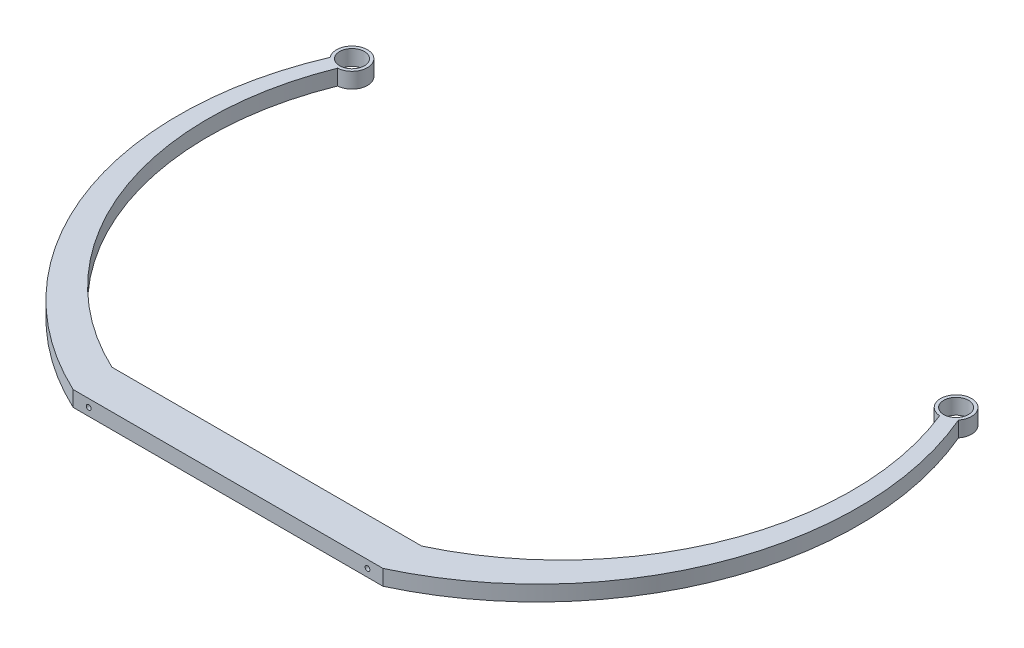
ISO-10303-21;
HEADER;
FILE_DESCRIPTION(('STEP AP214'),'2;1');
FILE_NAME('part.step','',(''),(''),'','','');
FILE_SCHEMA(('AUTOMOTIVE_DESIGN { 1 0 10303 214 1 1 1 1 }'));
ENDSEC;
DATA;
#1=APPLICATION_CONTEXT('core data for automotive mechanical design processes');
#2=APPLICATION_PROTOCOL_DEFINITION('international standard','automotive_design',2000,#1);
#3=PRODUCT_CONTEXT('',#1,'mechanical');
#4=PRODUCT('Part','Part','',(#3));
#5=PRODUCT_RELATED_PRODUCT_CATEGORY('part','',(#4));
#6=PRODUCT_DEFINITION_FORMATION('','',#4);
#7=PRODUCT_DEFINITION_CONTEXT('part definition',#1,'design');
#8=PRODUCT_DEFINITION('design','',#6,#7);
#9=PRODUCT_DEFINITION_SHAPE('','',#8);
#10=(LENGTH_UNIT() NAMED_UNIT(*) SI_UNIT(.MILLI.,.METRE.));
#11=(NAMED_UNIT(*) PLANE_ANGLE_UNIT() SI_UNIT($,.RADIAN.));
#12=(NAMED_UNIT(*) SI_UNIT($,.STERADIAN.) SOLID_ANGLE_UNIT());
#13=UNCERTAINTY_MEASURE_WITH_UNIT(LENGTH_MEASURE(1.E-05),#10,'distance_accuracy_value','');
#14=(GEOMETRIC_REPRESENTATION_CONTEXT(3) GLOBAL_UNCERTAINTY_ASSIGNED_CONTEXT((#13)) GLOBAL_UNIT_ASSIGNED_CONTEXT((#10,
#11,#12)) REPRESENTATION_CONTEXT('',''));
#15=CARTESIAN_POINT('',(0.,0.,0.));
#16=DIRECTION('',(0.,0.,1.));
#17=DIRECTION('',(1.,0.,0.));
#18=AXIS2_PLACEMENT_3D('',#15,#16,#17);
#19=CARTESIAN_POINT('',(-20.,10.,-52.4999999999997));
#20=DIRECTION('',(0.,-1.,0.));
#21=DIRECTION('',(0.,0.,-1.));
#22=AXIS2_PLACEMENT_3D('',#19,#20,#21);
#23=CYLINDRICAL_SURFACE('',#22,187.882942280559);
#24=CARTESIAN_POINT('',(-20.,0.,-52.4999999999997));
#25=DIRECTION('',(0.,1.,0.));
#26=DIRECTION('',(0.,0.,1.));
#27=AXIS2_PLACEMENT_3D('',#24,#25,#26);
#28=CIRCLE('',#27,187.882942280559);
#29=CARTESIAN_POINT('',(-194.347397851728,0.,-122.521317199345));
#30=VERTEX_POINT('',#29);
#31=CARTESIAN_POINT('',(-100.,0.,117.5));
#32=VERTEX_POINT('',#31);
#33=EDGE_CURVE('E134',#30,#32,#28,.T.);
#34=ORIENTED_EDGE('',*,*,#33,.F.);
#35=DIRECTION('',(0.,-1.,0.));
#36=VECTOR('',#35,1.);
#37=CARTESIAN_POINT('',(-194.347397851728,10.,-122.521317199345));
#38=LINE('',#37,#36);
#39=CARTESIAN_POINT('',(-194.347397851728,10.,-122.521317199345));
#40=VERTEX_POINT('',#39);
#41=EDGE_CURVE('E11',#40,#30,#38,.T.);
#42=ORIENTED_EDGE('',*,*,#41,.F.);
#43=CARTESIAN_POINT('',(-20.,10.,-52.4999999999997));
#44=DIRECTION('',(0.,1.,0.));
#45=DIRECTION('',(0.,0.,1.));
#46=AXIS2_PLACEMENT_3D('',#43,#44,#45);
#47=CIRCLE('',#46,187.882942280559);
#48=CARTESIAN_POINT('',(-100.,10.,117.5));
#49=VERTEX_POINT('',#48);
#50=EDGE_CURVE('E155',#40,#49,#47,.T.);
#51=ORIENTED_EDGE('',*,*,#50,.T.);
#52=DIRECTION('',(0.,-1.,0.));
#53=VECTOR('',#52,1.);
#54=CARTESIAN_POINT('',(-100.,10.,117.5));
#55=LINE('',#54,#53);
#56=EDGE_CURVE('E91',#49,#32,#55,.T.);
#57=ORIENTED_EDGE('',*,*,#56,.T.);
#58=EDGE_LOOP('',(#34,#42,#51,#57));
#59=FACE_BOUND('',#58,.T.);
#60=ADVANCED_FACE('F41',(#59),#23,.F.);
#61=CARTESIAN_POINT('',(-195.,10.,-132.5));
#62=DIRECTION('',(0.,-1.,0.));
#63=DIRECTION('',(0.,0.,-1.));
#64=AXIS2_PLACEMENT_3D('',#61,#62,#63);
#65=CYLINDRICAL_SURFACE('',#64,10.0000000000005);
#66=CARTESIAN_POINT('',(-195.,0.,-132.5));
#67=DIRECTION('',(0.,1.,0.));
#68=DIRECTION('',(0.,0.,1.));
#69=AXIS2_PLACEMENT_3D('',#66,#67,#68);
#70=CIRCLE('',#69,10.0000000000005);
#71=CARTESIAN_POINT('',(-202.796765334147,0.,-126.238175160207));
#72=VERTEX_POINT('',#71);
#73=EDGE_CURVE('E137',#72,#30,#70,.F.);
#74=ORIENTED_EDGE('',*,*,#73,.F.);
#75=DIRECTION('',(0.,-1.,0.));
#76=VECTOR('',#75,1.);
#77=CARTESIAN_POINT('',(-202.796765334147,10.,-126.238175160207));
#78=LINE('',#77,#76);
#79=CARTESIAN_POINT('',(-202.796765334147,10.,-126.238175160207));
#80=VERTEX_POINT('',#79);
#81=EDGE_CURVE('E49',#80,#72,#78,.T.);
#82=ORIENTED_EDGE('',*,*,#81,.F.);
#83=CARTESIAN_POINT('',(-195.,10.,-132.5));
#84=DIRECTION('',(0.,1.,0.));
#85=DIRECTION('',(0.,0.,1.));
#86=AXIS2_PLACEMENT_3D('',#83,#84,#85);
#87=CIRCLE('',#86,10.0000000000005);
#88=EDGE_CURVE('E177',#80,#40,#87,.F.);
#89=ORIENTED_EDGE('',*,*,#88,.T.);
#90=ORIENTED_EDGE('',*,*,#41,.T.);
#91=EDGE_LOOP('',(#74,#82,#89,#90));
#92=FACE_BOUND('',#91,.T.);
#93=ADVANCED_FACE('F176',(#92),#65,.T.);
#94=CARTESIAN_POINT('',(-12.4999999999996,10.,-44.9999999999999));
#95=DIRECTION('',(0.,-1.,0.));
#96=DIRECTION('',(0.,0.,-1.));
#97=AXIS2_PLACEMENT_3D('',#94,#95,#96);
#98=CYLINDRICAL_SURFACE('',#97,206.911816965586);
#99=CARTESIAN_POINT('',(-12.4999999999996,0.,-44.9999999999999));
#100=DIRECTION('',(0.,1.,0.));
#101=DIRECTION('',(0.,0.,1.));
#102=AXIS2_PLACEMENT_3D('',#99,#100,#101);
#103=CIRCLE('',#102,206.911816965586);
#104=CARTESIAN_POINT('',(-100.,0.,142.5));
#105=VERTEX_POINT('',#104);
#106=EDGE_CURVE('E141',#72,#105,#103,.T.);
#107=ORIENTED_EDGE('',*,*,#106,.T.);
#108=DIRECTION('',(0.,-1.,0.));
#109=VECTOR('',#108,1.);
#110=CARTESIAN_POINT('',(-100.,10.,142.5));
#111=LINE('',#110,#109);
#112=CARTESIAN_POINT('',(-100.,10.,142.5));
#113=VERTEX_POINT('',#112);
#114=EDGE_CURVE('E161',#113,#105,#111,.T.);
#115=ORIENTED_EDGE('',*,*,#114,.F.);
#116=CARTESIAN_POINT('',(-12.4999999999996,10.,-44.9999999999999));
#117=DIRECTION('',(0.,1.,0.));
#118=DIRECTION('',(0.,0.,1.));
#119=AXIS2_PLACEMENT_3D('',#116,#117,#118);
#120=CIRCLE('',#119,206.911816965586);
#121=EDGE_CURVE('E167',#80,#113,#120,.T.);
#122=ORIENTED_EDGE('',*,*,#121,.F.);
#123=ORIENTED_EDGE('',*,*,#81,.T.);
#124=EDGE_LOOP('',(#107,#115,#122,#123));
#125=FACE_BOUND('',#124,.T.);
#126=ADVANCED_FACE('F165',(#125),#98,.T.);
#127=CARTESIAN_POINT('',(0.,10.,142.5));
#128=DIRECTION('',(0.,0.,1.));
#129=DIRECTION('',(1.,0.,0.));
#130=AXIS2_PLACEMENT_3D('',#127,#128,#129);
#131=PLANE('',#130);
#132=CARTESIAN_POINT('',(90.,5.,142.5));
#133=DIRECTION('',(0.,0.,-1.));
#134=DIRECTION('',(-1.,0.,0.));
#135=AXIS2_PLACEMENT_3D('',#132,#133,#134);
#136=CIRCLE('',#135,1.54999999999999);
#137=CARTESIAN_POINT('',(88.45,5.,142.5));
#138=VERTEX_POINT('',#137);
#139=EDGE_CURVE('E316',#138,#138,#136,.T.);
#140=ORIENTED_EDGE('',*,*,#139,.T.);
#141=EDGE_LOOP('',(#140));
#142=FACE_BOUND('',#141,.T.);
#143=CARTESIAN_POINT('',(-90.,5.00000000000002,142.5));
#144=DIRECTION('',(0.,0.,-1.));
#145=DIRECTION('',(-1.,0.,0.));
#146=AXIS2_PLACEMENT_3D('',#143,#144,#145);
#147=CIRCLE('',#146,1.54999999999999);
#148=CARTESIAN_POINT('',(-91.55,5.00000000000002,142.5));
#149=VERTEX_POINT('',#148);
#150=EDGE_CURVE('E322',#149,#149,#147,.T.);
#151=ORIENTED_EDGE('',*,*,#150,.T.);
#152=EDGE_LOOP('',(#151));
#153=FACE_BOUND('',#152,.T.);
#154=DIRECTION('',(-1.,0.,0.));
#155=VECTOR('',#154,1.);
#156=CARTESIAN_POINT('',(0.,0.,142.5));
#157=LINE('',#156,#155);
#158=CARTESIAN_POINT('',(100.,0.,142.5));
#159=VERTEX_POINT('',#158);
#160=EDGE_CURVE('E144',#159,#105,#157,.T.);
#161=ORIENTED_EDGE('',*,*,#160,.F.);
#162=DIRECTION('',(0.,-1.,0.));
#163=VECTOR('',#162,1.);
#164=CARTESIAN_POINT('',(100.,10.,142.5));
#165=LINE('',#164,#163);
#166=CARTESIAN_POINT('',(100.,10.,142.5));
#167=VERTEX_POINT('',#166);
#168=EDGE_CURVE('E159',#167,#159,#165,.T.);
#169=ORIENTED_EDGE('',*,*,#168,.F.);
#170=DIRECTION('',(-1.,0.,0.));
#171=VECTOR('',#170,1.);
#172=CARTESIAN_POINT('',(0.,10.,142.5));
#173=LINE('',#172,#171);
#174=EDGE_CURVE('E186',#167,#113,#173,.T.);
#175=ORIENTED_EDGE('',*,*,#174,.T.);
#176=ORIENTED_EDGE('',*,*,#114,.T.);
#177=EDGE_LOOP('',(#161,#169,#175,#176));
#178=FACE_BOUND('',#177,.T.);
#179=ADVANCED_FACE('F189',(#142,#153,#178),#131,.T.);
#180=CARTESIAN_POINT('',(12.499999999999,10.,-45.0000000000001));
#181=DIRECTION('',(0.,-1.,0.));
#182=DIRECTION('',(0.,0.,-1.));
#183=AXIS2_PLACEMENT_3D('',#180,#181,#182);
#184=CYLINDRICAL_SURFACE('',#183,206.911816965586);
#185=CARTESIAN_POINT('',(12.499999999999,0.,-45.0000000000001));
#186=DIRECTION('',(0.,1.,0.));
#187=DIRECTION('',(0.,0.,1.));
#188=AXIS2_PLACEMENT_3D('',#185,#186,#187);
#189=CIRCLE('',#188,206.911816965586);
#190=CARTESIAN_POINT('',(202.796765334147,0.,-126.238175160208));
#191=VERTEX_POINT('',#190);
#192=EDGE_CURVE('E147',#159,#191,#189,.T.);
#193=ORIENTED_EDGE('',*,*,#192,.T.);
#194=DIRECTION('',(0.,-1.,0.));
#195=VECTOR('',#194,1.);
#196=CARTESIAN_POINT('',(202.796765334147,10.,-126.238175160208));
#197=LINE('',#196,#195);
#198=CARTESIAN_POINT('',(202.796765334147,10.,-126.238175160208));
#199=VERTEX_POINT('',#198);
#200=EDGE_CURVE('E120',#199,#191,#197,.T.);
#201=ORIENTED_EDGE('',*,*,#200,.F.);
#202=CARTESIAN_POINT('',(12.499999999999,10.,-45.0000000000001));
#203=DIRECTION('',(0.,1.,0.));
#204=DIRECTION('',(0.,0.,1.));
#205=AXIS2_PLACEMENT_3D('',#202,#203,#204);
#206=CIRCLE('',#205,206.911816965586);
#207=EDGE_CURVE('E126',#167,#199,#206,.T.);
#208=ORIENTED_EDGE('',*,*,#207,.F.);
#209=ORIENTED_EDGE('',*,*,#168,.T.);
#210=EDGE_LOOP('',(#193,#201,#208,#209));
#211=FACE_BOUND('',#210,.T.);
#212=ADVANCED_FACE('F191',(#211),#184,.T.);
#213=CARTESIAN_POINT('',(195.,10.,-132.5));
#214=DIRECTION('',(0.,-1.,0.));
#215=DIRECTION('',(0.,0.,-1.));
#216=AXIS2_PLACEMENT_3D('',#213,#214,#215);
#217=CYLINDRICAL_SURFACE('',#216,9.99999999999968);
#218=CARTESIAN_POINT('',(195.,0.,-132.5));
#219=DIRECTION('',(0.,1.,0.));
#220=DIRECTION('',(0.,0.,1.));
#221=AXIS2_PLACEMENT_3D('',#218,#219,#220);
#222=CIRCLE('',#221,9.99999999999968);
#223=CARTESIAN_POINT('',(194.347397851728,0.,-122.521317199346));
#224=VERTEX_POINT('',#223);
#225=EDGE_CURVE('E115',#224,#191,#222,.F.);
#226=ORIENTED_EDGE('',*,*,#225,.F.);
#227=DIRECTION('',(0.,-1.,0.));
#228=VECTOR('',#227,1.);
#229=CARTESIAN_POINT('',(194.347397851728,10.,-122.521317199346));
#230=LINE('',#229,#228);
#231=CARTESIAN_POINT('',(194.347397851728,10.,-122.521317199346));
#232=VERTEX_POINT('',#231);
#233=EDGE_CURVE('E110',#232,#224,#230,.T.);
#234=ORIENTED_EDGE('',*,*,#233,.F.);
#235=CARTESIAN_POINT('',(195.,10.,-132.5));
#236=DIRECTION('',(0.,1.,0.));
#237=DIRECTION('',(0.,0.,1.));
#238=AXIS2_PLACEMENT_3D('',#235,#236,#237);
#239=CIRCLE('',#238,9.99999999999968);
#240=EDGE_CURVE('E113',#232,#199,#239,.F.);
#241=ORIENTED_EDGE('',*,*,#240,.T.);
#242=ORIENTED_EDGE('',*,*,#200,.T.);
#243=EDGE_LOOP('',(#226,#234,#241,#242));
#244=FACE_BOUND('',#243,.T.);
#245=ADVANCED_FACE('F112',(#244),#217,.T.);
#246=CARTESIAN_POINT('',(19.9999999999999,10.,-52.4999999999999));
#247=DIRECTION('',(0.,-1.,0.));
#248=DIRECTION('',(0.,0.,-1.));
#249=AXIS2_PLACEMENT_3D('',#246,#247,#248);
#250=CYLINDRICAL_SURFACE('',#249,187.88294228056);
#251=CARTESIAN_POINT('',(19.9999999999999,0.,-52.4999999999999));
#252=DIRECTION('',(0.,1.,0.));
#253=DIRECTION('',(0.,0.,1.));
#254=AXIS2_PLACEMENT_3D('',#251,#252,#253);
#255=CIRCLE('',#254,187.88294228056);
#256=CARTESIAN_POINT('',(100.,0.,117.5));
#257=VERTEX_POINT('',#256);
#258=EDGE_CURVE('E151',#257,#224,#255,.T.);
#259=ORIENTED_EDGE('',*,*,#258,.F.);
#260=DIRECTION('',(0.,-1.,0.));
#261=VECTOR('',#260,1.);
#262=CARTESIAN_POINT('',(100.,10.,117.5));
#263=LINE('',#262,#261);
#264=CARTESIAN_POINT('',(100.,10.,117.5));
#265=VERTEX_POINT('',#264);
#266=EDGE_CURVE('E84',#265,#257,#263,.T.);
#267=ORIENTED_EDGE('',*,*,#266,.F.);
#268=CARTESIAN_POINT('',(19.9999999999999,10.,-52.4999999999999));
#269=DIRECTION('',(0.,1.,0.));
#270=DIRECTION('',(0.,0.,1.));
#271=AXIS2_PLACEMENT_3D('',#268,#269,#270);
#272=CIRCLE('',#271,187.88294228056);
#273=EDGE_CURVE('E123',#265,#232,#272,.T.);
#274=ORIENTED_EDGE('',*,*,#273,.T.);
#275=ORIENTED_EDGE('',*,*,#233,.T.);
#276=EDGE_LOOP('',(#259,#267,#274,#275));
#277=FACE_BOUND('',#276,.T.);
#278=ADVANCED_FACE('F129',(#277),#250,.F.);
#279=CARTESIAN_POINT('',(0.,10.,117.5));
#280=DIRECTION('',(0.,0.,1.));
#281=DIRECTION('',(1.,0.,0.));
#282=AXIS2_PLACEMENT_3D('',#279,#280,#281);
#283=PLANE('',#282);
#284=CARTESIAN_POINT('',(90.,5.,117.5));
#285=DIRECTION('',(0.,0.,-1.));
#286=DIRECTION('',(-1.,0.,0.));
#287=AXIS2_PLACEMENT_3D('',#284,#285,#286);
#288=CIRCLE('',#287,1.54999999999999);
#289=CARTESIAN_POINT('',(88.45,5.,117.5));
#290=VERTEX_POINT('',#289);
#291=EDGE_CURVE('E325',#290,#290,#288,.T.);
#292=ORIENTED_EDGE('',*,*,#291,.F.);
#293=EDGE_LOOP('',(#292));
#294=FACE_BOUND('',#293,.T.);
#295=CARTESIAN_POINT('',(-90.,5.00000000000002,117.5));
#296=DIRECTION('',(0.,0.,-1.));
#297=DIRECTION('',(-1.,0.,0.));
#298=AXIS2_PLACEMENT_3D('',#295,#296,#297);
#299=CIRCLE('',#298,1.54999999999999);
#300=CARTESIAN_POINT('',(-91.55,5.00000000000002,117.5));
#301=VERTEX_POINT('',#300);
#302=EDGE_CURVE('E319',#301,#301,#299,.T.);
#303=ORIENTED_EDGE('',*,*,#302,.F.);
#304=EDGE_LOOP('',(#303));
#305=FACE_BOUND('',#304,.T.);
#306=DIRECTION('',(-1.,0.,0.));
#307=VECTOR('',#306,1.);
#308=CARTESIAN_POINT('',(0.,0.,117.5));
#309=LINE('',#308,#307);
#310=EDGE_CURVE('E153',#257,#32,#309,.T.);
#311=ORIENTED_EDGE('',*,*,#310,.T.);
#312=ORIENTED_EDGE('',*,*,#56,.F.);
#313=DIRECTION('',(-1.,0.,0.));
#314=VECTOR('',#313,1.);
#315=CARTESIAN_POINT('',(0.,10.,117.5));
#316=LINE('',#315,#314);
#317=EDGE_CURVE('E57',#265,#49,#316,.T.);
#318=ORIENTED_EDGE('',*,*,#317,.F.);
#319=ORIENTED_EDGE('',*,*,#266,.T.);
#320=EDGE_LOOP('',(#311,#312,#318,#319));
#321=FACE_BOUND('',#320,.T.);
#322=ADVANCED_FACE('F178',(#294,#305,#321),#283,.F.);
#323=CARTESIAN_POINT('',(0.,10.,0.));
#324=DIRECTION('',(0.,1.,0.));
#325=DIRECTION('',(0.,0.,1.));
#326=AXIS2_PLACEMENT_3D('',#323,#324,#325);
#327=PLANE('',#326);
#328=CARTESIAN_POINT('',(-195.,10.,-132.5));
#329=DIRECTION('',(0.,1.,0.));
#330=DIRECTION('',(0.,0.,1.));
#331=AXIS2_PLACEMENT_3D('',#328,#329,#330);
#332=CIRCLE('',#331,8.00000000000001);
#333=CARTESIAN_POINT('',(-195.,10.,-124.5));
#334=VERTEX_POINT('',#333);
#335=EDGE_CURVE('E312',#334,#334,#332,.T.);
#336=ORIENTED_EDGE('',*,*,#335,.F.);
#337=EDGE_LOOP('',(#336));
#338=FACE_BOUND('',#337,.T.);
#339=CARTESIAN_POINT('',(195.,10.,-132.5));
#340=DIRECTION('',(0.,1.,0.));
#341=DIRECTION('',(0.,0.,1.));
#342=AXIS2_PLACEMENT_3D('',#339,#340,#341);
#343=CIRCLE('',#342,8.00000000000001);
#344=CARTESIAN_POINT('',(195.,10.,-124.5));
#345=VERTEX_POINT('',#344);
#346=EDGE_CURVE('E182',#345,#345,#343,.T.);
#347=ORIENTED_EDGE('',*,*,#346,.F.);
#348=EDGE_LOOP('',(#347));
#349=FACE_BOUND('',#348,.T.);
#350=ORIENTED_EDGE('',*,*,#50,.F.);
#351=ORIENTED_EDGE('',*,*,#88,.F.);
#352=ORIENTED_EDGE('',*,*,#121,.T.);
#353=ORIENTED_EDGE('',*,*,#174,.F.);
#354=ORIENTED_EDGE('',*,*,#207,.T.);
#355=ORIENTED_EDGE('',*,*,#240,.F.);
#356=ORIENTED_EDGE('',*,*,#273,.F.);
#357=ORIENTED_EDGE('',*,*,#317,.T.);
#358=EDGE_LOOP('',(#350,#351,#352,#353,#354,#355,#356,#357));
#359=FACE_BOUND('',#358,.T.);
#360=ADVANCED_FACE('F122',(#338,#349,#359),#327,.T.);
#361=CARTESIAN_POINT('',(0.,0.,0.));
#362=DIRECTION('',(0.,1.,0.));
#363=DIRECTION('',(0.,0.,1.));
#364=AXIS2_PLACEMENT_3D('',#361,#362,#363);
#365=PLANE('',#364);
#366=CARTESIAN_POINT('',(-195.,0.,-132.5));
#367=DIRECTION('',(0.,1.,0.));
#368=DIRECTION('',(0.,0.,1.));
#369=AXIS2_PLACEMENT_3D('',#366,#367,#368);
#370=CIRCLE('',#369,8.00000000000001);
#371=CARTESIAN_POINT('',(-195.,0.,-124.5));
#372=VERTEX_POINT('',#371);
#373=EDGE_CURVE('E138',#372,#372,#370,.T.);
#374=ORIENTED_EDGE('',*,*,#373,.T.);
#375=EDGE_LOOP('',(#374));
#376=FACE_BOUND('',#375,.T.);
#377=CARTESIAN_POINT('',(195.,0.,-132.5));
#378=DIRECTION('',(0.,1.,0.));
#379=DIRECTION('',(0.,0.,1.));
#380=AXIS2_PLACEMENT_3D('',#377,#378,#379);
#381=CIRCLE('',#380,8.00000000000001);
#382=CARTESIAN_POINT('',(195.,0.,-124.5));
#383=VERTEX_POINT('',#382);
#384=EDGE_CURVE('E311',#383,#383,#381,.T.);
#385=ORIENTED_EDGE('',*,*,#384,.T.);
#386=EDGE_LOOP('',(#385));
#387=FACE_BOUND('',#386,.T.);
#388=ORIENTED_EDGE('',*,*,#33,.T.);
#389=ORIENTED_EDGE('',*,*,#310,.F.);
#390=ORIENTED_EDGE('',*,*,#258,.T.);
#391=ORIENTED_EDGE('',*,*,#225,.T.);
#392=ORIENTED_EDGE('',*,*,#192,.F.);
#393=ORIENTED_EDGE('',*,*,#160,.T.);
#394=ORIENTED_EDGE('',*,*,#106,.F.);
#395=ORIENTED_EDGE('',*,*,#73,.T.);
#396=EDGE_LOOP('',(#388,#389,#390,#391,#392,#393,#394,#395));
#397=FACE_BOUND('',#396,.T.);
#398=ADVANCED_FACE('F173',(#376,#387,#397),#365,.F.);
#399=CARTESIAN_POINT('',(195.,0.,-132.5));
#400=DIRECTION('',(0.,1.,0.));
#401=DIRECTION('',(0.,0.,1.));
#402=AXIS2_PLACEMENT_3D('',#399,#400,#401);
#403=CYLINDRICAL_SURFACE('',#402,8.00000000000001);
#404=ORIENTED_EDGE('',*,*,#384,.F.);
#405=EDGE_LOOP('',(#404));
#406=FACE_BOUND('',#405,.T.);
#407=ORIENTED_EDGE('',*,*,#346,.T.);
#408=EDGE_LOOP('',(#407));
#409=FACE_BOUND('',#408,.T.);
#410=ADVANCED_FACE('F263',(#406,#409),#403,.F.);
#411=CARTESIAN_POINT('',(-195.,0.,-132.5));
#412=DIRECTION('',(0.,1.,0.));
#413=DIRECTION('',(0.,0.,1.));
#414=AXIS2_PLACEMENT_3D('',#411,#412,#413);
#415=CYLINDRICAL_SURFACE('',#414,8.00000000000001);
#416=ORIENTED_EDGE('',*,*,#373,.F.);
#417=EDGE_LOOP('',(#416));
#418=FACE_BOUND('',#417,.T.);
#419=ORIENTED_EDGE('',*,*,#335,.T.);
#420=EDGE_LOOP('',(#419));
#421=FACE_BOUND('',#420,.T.);
#422=ADVANCED_FACE('F222',(#418,#421),#415,.F.);
#423=CARTESIAN_POINT('',(-90.,5.00000000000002,142.5));
#424=DIRECTION('',(0.,0.,-1.));
#425=DIRECTION('',(-1.,0.,0.));
#426=AXIS2_PLACEMENT_3D('',#423,#424,#425);
#427=CYLINDRICAL_SURFACE('',#426,1.54999999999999);
#428=ORIENTED_EDGE('',*,*,#150,.F.);
#429=EDGE_LOOP('',(#428));
#430=FACE_BOUND('',#429,.T.);
#431=ORIENTED_EDGE('',*,*,#302,.T.);
#432=EDGE_LOOP('',(#431));
#433=FACE_BOUND('',#432,.T.);
#434=ADVANCED_FACE('F240',(#430,#433),#427,.F.);
#435=CARTESIAN_POINT('',(90.,5.,142.5));
#436=DIRECTION('',(0.,0.,-1.));
#437=DIRECTION('',(-1.,0.,0.));
#438=AXIS2_PLACEMENT_3D('',#435,#436,#437);
#439=CYLINDRICAL_SURFACE('',#438,1.54999999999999);
#440=ORIENTED_EDGE('',*,*,#139,.F.);
#441=EDGE_LOOP('',(#440));
#442=FACE_BOUND('',#441,.T.);
#443=ORIENTED_EDGE('',*,*,#291,.T.);
#444=EDGE_LOOP('',(#443));
#445=FACE_BOUND('',#444,.T.);
#446=ADVANCED_FACE('F245',(#442,#445),#439,.F.);
#447=CLOSED_SHELL('',(#60,#93,#126,#179,#212,#245,#278,#322,#360,#398,#410,#422,#434,#446));
#448=MANIFOLD_SOLID_BREP('B2',#447);
#449=ADVANCED_BREP_SHAPE_REPRESENTATION('',(#18,#448),#14);
#450=SHAPE_DEFINITION_REPRESENTATION(#9,#449);
ENDSEC;
END-ISO-10303-21;
